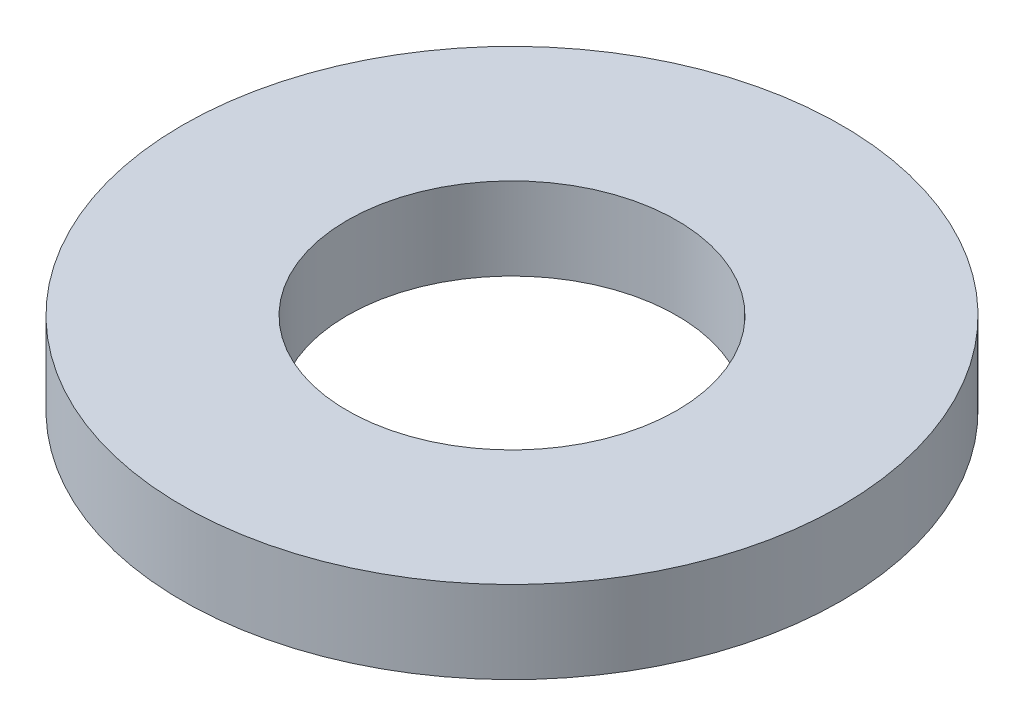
ISO-10303-21;
HEADER;
FILE_DESCRIPTION(('STEP AP214'),'2;1');
FILE_NAME('part.step','',(''),(''),'','','');
FILE_SCHEMA(('AUTOMOTIVE_DESIGN { 1 0 10303 214 1 1 1 1 }'));
ENDSEC;
DATA;
#1=APPLICATION_CONTEXT('core data for automotive mechanical design processes');
#2=APPLICATION_PROTOCOL_DEFINITION('international standard','automotive_design',2000,#1);
#3=PRODUCT_CONTEXT('',#1,'mechanical');
#4=PRODUCT('Part','Part','',(#3));
#5=PRODUCT_RELATED_PRODUCT_CATEGORY('part','',(#4));
#6=PRODUCT_DEFINITION_FORMATION('','',#4);
#7=PRODUCT_DEFINITION_CONTEXT('part definition',#1,'design');
#8=PRODUCT_DEFINITION('design','',#6,#7);
#9=PRODUCT_DEFINITION_SHAPE('','',#8);
#10=(LENGTH_UNIT() NAMED_UNIT(*) SI_UNIT(.MILLI.,.METRE.));
#11=(NAMED_UNIT(*) PLANE_ANGLE_UNIT() SI_UNIT($,.RADIAN.));
#12=(NAMED_UNIT(*) SI_UNIT($,.STERADIAN.) SOLID_ANGLE_UNIT());
#13=UNCERTAINTY_MEASURE_WITH_UNIT(LENGTH_MEASURE(1.E-05),#10,'distance_accuracy_value','');
#14=(GEOMETRIC_REPRESENTATION_CONTEXT(3) GLOBAL_UNCERTAINTY_ASSIGNED_CONTEXT((#13)) GLOBAL_UNIT_ASSIGNED_CONTEXT((#10,
#11,#12)) REPRESENTATION_CONTEXT('',''));
#15=CARTESIAN_POINT('',(0.,0.,0.));
#16=DIRECTION('',(0.,0.,1.));
#17=DIRECTION('',(1.,0.,0.));
#18=AXIS2_PLACEMENT_3D('',#15,#16,#17);
#19=CARTESIAN_POINT('',(0.,1.5,0.));
#20=DIRECTION('',(0.,-1.,0.));
#21=DIRECTION('',(1.,0.,0.));
#22=AXIS2_PLACEMENT_3D('',#19,#20,#21);
#23=CYLINDRICAL_SURFACE('',#22,12.);
#24=CARTESIAN_POINT('',(0.,3.,0.));
#25=DIRECTION('',(0.,1.,0.));
#26=DIRECTION('',(1.,0.,0.));
#27=AXIS2_PLACEMENT_3D('',#24,#25,#26);
#28=CIRCLE('',#27,12.);
#29=CARTESIAN_POINT('',(12.,3.,0.));
#30=VERTEX_POINT('',#29);
#31=EDGE_CURVE('E27',#30,#30,#28,.T.);
#32=ORIENTED_EDGE('',*,*,#31,.F.);
#33=EDGE_LOOP('',(#32));
#34=FACE_BOUND('',#33,.T.);
#35=CARTESIAN_POINT('',(0.,0.,0.));
#36=DIRECTION('',(0.,1.,0.));
#37=DIRECTION('',(1.,0.,0.));
#38=AXIS2_PLACEMENT_3D('',#35,#36,#37);
#39=CIRCLE('',#38,12.);
#40=CARTESIAN_POINT('',(12.,0.,0.));
#41=VERTEX_POINT('',#40);
#42=EDGE_CURVE('E11',#41,#41,#39,.T.);
#43=ORIENTED_EDGE('',*,*,#42,.T.);
#44=EDGE_LOOP('',(#43));
#45=FACE_BOUND('',#44,.T.);
#46=ADVANCED_FACE('F16',(#34,#45),#23,.T.);
#47=CARTESIAN_POINT('',(9.,3.,0.));
#48=DIRECTION('',(0.,1.,0.));
#49=DIRECTION('',(1.,0.,0.));
#50=AXIS2_PLACEMENT_3D('',#47,#48,#49);
#51=PLANE('',#50);
#52=CARTESIAN_POINT('',(0.,3.,0.));
#53=DIRECTION('',(0.,1.,0.));
#54=DIRECTION('',(1.,0.,0.));
#55=AXIS2_PLACEMENT_3D('',#52,#53,#54);
#56=CIRCLE('',#55,6.);
#57=CARTESIAN_POINT('',(6.,3.,0.));
#58=VERTEX_POINT('',#57);
#59=EDGE_CURVE('E43',#58,#58,#56,.T.);
#60=ORIENTED_EDGE('',*,*,#59,.F.);
#61=EDGE_LOOP('',(#60));
#62=FACE_BOUND('',#61,.T.);
#63=ORIENTED_EDGE('',*,*,#31,.T.);
#64=EDGE_LOOP('',(#63));
#65=FACE_BOUND('',#64,.T.);
#66=ADVANCED_FACE('F44',(#62,#65),#51,.T.);
#67=CARTESIAN_POINT('',(0.,1.5,0.));
#68=DIRECTION('',(0.,-1.,0.));
#69=DIRECTION('',(1.,0.,0.));
#70=AXIS2_PLACEMENT_3D('',#67,#68,#69);
#71=CYLINDRICAL_SURFACE('',#70,6.);
#72=CARTESIAN_POINT('',(0.,0.,0.));
#73=DIRECTION('',(0.,1.,0.));
#74=DIRECTION('',(1.,0.,0.));
#75=AXIS2_PLACEMENT_3D('',#72,#73,#74);
#76=CIRCLE('',#75,6.);
#77=CARTESIAN_POINT('',(6.,0.,0.));
#78=VERTEX_POINT('',#77);
#79=EDGE_CURVE('E20',#78,#78,#76,.T.);
#80=ORIENTED_EDGE('',*,*,#79,.F.);
#81=EDGE_LOOP('',(#80));
#82=FACE_BOUND('',#81,.T.);
#83=ORIENTED_EDGE('',*,*,#59,.T.);
#84=EDGE_LOOP('',(#83));
#85=FACE_BOUND('',#84,.T.);
#86=ADVANCED_FACE('F18',(#82,#85),#71,.F.);
#87=CARTESIAN_POINT('',(9.,0.,0.));
#88=DIRECTION('',(0.,-1.,0.));
#89=DIRECTION('',(-1.,0.,0.));
#90=AXIS2_PLACEMENT_3D('',#87,#88,#89);
#91=PLANE('',#90);
#92=ORIENTED_EDGE('',*,*,#42,.F.);
#93=EDGE_LOOP('',(#92));
#94=FACE_BOUND('',#93,.T.);
#95=ORIENTED_EDGE('',*,*,#79,.T.);
#96=EDGE_LOOP('',(#95));
#97=FACE_BOUND('',#96,.T.);
#98=ADVANCED_FACE('F53',(#94,#97),#91,.T.);
#99=CLOSED_SHELL('',(#46,#66,#86,#98));
#100=MANIFOLD_SOLID_BREP('B1',#99);
#101=ADVANCED_BREP_SHAPE_REPRESENTATION('',(#18,#100),#14);
#102=SHAPE_DEFINITION_REPRESENTATION(#9,#101);
ENDSEC;
END-ISO-10303-21;
